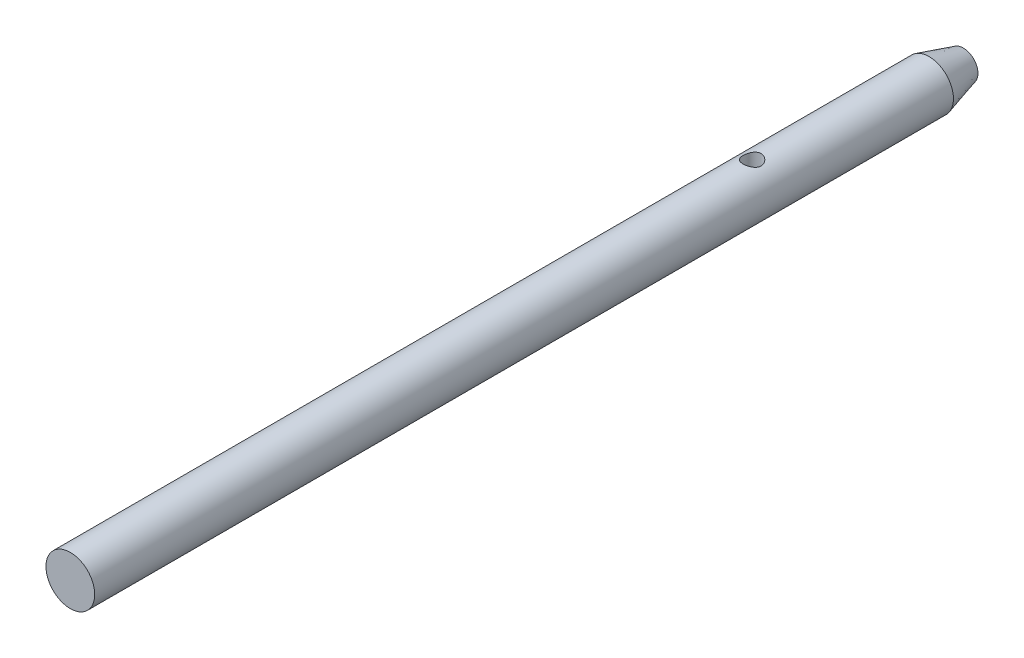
ISO-10303-21;
HEADER;
FILE_DESCRIPTION(('STEP AP214'),'2;1');
FILE_NAME('part.step','',(''),(''),'','','');
FILE_SCHEMA(('AUTOMOTIVE_DESIGN { 1 0 10303 214 1 1 1 1 }'));
ENDSEC;
DATA;
#1=APPLICATION_CONTEXT('core data for automotive mechanical design processes');
#2=APPLICATION_PROTOCOL_DEFINITION('international standard','automotive_design',2000,#1);
#3=PRODUCT_CONTEXT('',#1,'mechanical');
#4=PRODUCT('Part','Part','',(#3));
#5=PRODUCT_RELATED_PRODUCT_CATEGORY('part','',(#4));
#6=PRODUCT_DEFINITION_FORMATION('','',#4);
#7=PRODUCT_DEFINITION_CONTEXT('part definition',#1,'design');
#8=PRODUCT_DEFINITION('design','',#6,#7);
#9=PRODUCT_DEFINITION_SHAPE('','',#8);
#10=(LENGTH_UNIT() NAMED_UNIT(*) SI_UNIT(.MILLI.,.METRE.));
#11=(NAMED_UNIT(*) PLANE_ANGLE_UNIT() SI_UNIT($,.RADIAN.));
#12=(NAMED_UNIT(*) SI_UNIT($,.STERADIAN.) SOLID_ANGLE_UNIT());
#13=UNCERTAINTY_MEASURE_WITH_UNIT(LENGTH_MEASURE(1.E-05),#10,'distance_accuracy_value','');
#14=(GEOMETRIC_REPRESENTATION_CONTEXT(3) GLOBAL_UNCERTAINTY_ASSIGNED_CONTEXT((#13)) GLOBAL_UNIT_ASSIGNED_CONTEXT((#10,
#11,#12)) REPRESENTATION_CONTEXT('',''));
#15=CARTESIAN_POINT('',(0.,0.,0.));
#16=DIRECTION('',(0.,0.,1.));
#17=DIRECTION('',(1.,0.,0.));
#18=AXIS2_PLACEMENT_3D('',#15,#16,#17);
#19=CARTESIAN_POINT('',(0.,0.,78.2));
#20=DIRECTION('',(0.,0.,-1.));
#21=DIRECTION('',(-1.00000000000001,0.,0.));
#22=AXIS2_PLACEMENT_3D('',#19,#20,#21);
#23=CYLINDRICAL_SURFACE('',#22,2.135);
#24=CARTESIAN_POINT('',(0.,-2.135,19.2899999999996));
#25=CARTESIAN_POINT('',(-0.042823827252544,-2.1350009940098,19.2900013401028));
#26=CARTESIAN_POINT('',(-0.0856383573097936,-2.13370026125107,19.2865070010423));
#27=CARTESIAN_POINT('',(-0.169990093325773,-2.12864112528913,19.2726767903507));
#28=CARTESIAN_POINT('',(-0.211527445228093,-2.12488300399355,19.2623417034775));
#29=CARTESIAN_POINT('',(-0.292096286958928,-2.11531311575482,19.2352440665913));
#30=CARTESIAN_POINT('',(-0.331132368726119,-2.10950524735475,19.218493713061));
#31=CARTESIAN_POINT('',(-0.405838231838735,-2.09641609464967,19.1791021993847));
#32=CARTESIAN_POINT('',(-0.441507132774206,-2.08913442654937,19.1564595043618));
#33=CARTESIAN_POINT('',(-0.509946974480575,-2.07351338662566,19.1049435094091));
#34=CARTESIAN_POINT('',(-0.542559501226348,-2.06514462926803,19.0758687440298));
#35=CARTESIAN_POINT('',(-0.602572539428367,-2.04843928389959,19.012741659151));
#36=CARTESIAN_POINT('',(-0.629971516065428,-2.04010270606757,18.9786878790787));
#37=CARTESIAN_POINT('',(-0.679773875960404,-2.0240660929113,18.9050369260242));
#38=CARTESIAN_POINT('',(-0.701955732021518,-2.0164008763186,18.8652816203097));
#39=CARTESIAN_POINT('',(-0.739248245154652,-2.00303081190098,18.7822761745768));
#40=CARTESIAN_POINT('',(-0.754361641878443,-1.99732520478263,18.739027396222));
#41=CARTESIAN_POINT('',(-0.776466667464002,-1.98883394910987,18.6520839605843));
#42=CARTESIAN_POINT('',(-0.783760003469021,-1.98594026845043,18.6084769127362));
#43=CARTESIAN_POINT('',(-0.790961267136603,-1.98308390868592,18.5205692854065));
#44=CARTESIAN_POINT('',(-0.790872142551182,-1.98312005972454,18.4762689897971));
#45=CARTESIAN_POINT('',(-0.783542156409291,-1.98602593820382,18.3909682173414));
#46=CARTESIAN_POINT('',(-0.776716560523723,-1.98873113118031,18.3499254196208));
#47=CARTESIAN_POINT('',(-0.756792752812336,-1.99639737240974,18.2696154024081));
#48=CARTESIAN_POINT('',(-0.743693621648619,-2.00135875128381,18.2303484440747));
#49=CARTESIAN_POINT('',(-0.711361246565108,-2.01307961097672,18.1538464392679));
#50=CARTESIAN_POINT('',(-0.692018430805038,-2.01987082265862,18.1166627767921));
#51=CARTESIAN_POINT('',(-0.647824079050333,-2.03447524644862,18.0459472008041));
#52=CARTESIAN_POINT('',(-0.622970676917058,-2.04228880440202,18.0124165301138));
#53=CARTESIAN_POINT('',(-0.566549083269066,-2.05868010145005,17.947655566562));
#54=CARTESIAN_POINT('',(-0.534648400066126,-2.06727442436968,17.9167184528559));
#55=CARTESIAN_POINT('',(-0.466011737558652,-2.08381932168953,17.8605471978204));
#56=CARTESIAN_POINT('',(-0.429275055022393,-2.09176980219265,17.8353138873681));
#57=CARTESIAN_POINT('',(-0.351277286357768,-2.10628192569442,17.7909545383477));
#58=CARTESIAN_POINT('',(-0.309957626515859,-2.11282143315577,17.7719237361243));
#59=CARTESIAN_POINT('',(-0.224401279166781,-2.12361109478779,17.7411799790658));
#60=CARTESIAN_POINT('',(-0.180165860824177,-2.12786223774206,17.7294638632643));
#61=CARTESIAN_POINT('',(-0.0925029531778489,-2.1334236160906,17.7142401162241));
#62=CARTESIAN_POINT('',(-0.0491529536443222,-2.13487521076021,17.7103375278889));
#63=CARTESIAN_POINT('',(0.0376016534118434,-2.13510916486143,17.7097046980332));
#64=CARTESIAN_POINT('',(0.0810062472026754,-2.13389209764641,17.7129729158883));
#65=CARTESIAN_POINT('',(0.16494702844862,-2.12901880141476,17.726287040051));
#66=CARTESIAN_POINT('',(0.205529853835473,-2.12545500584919,17.7360762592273));
#67=CARTESIAN_POINT('',(0.284450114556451,-2.11633938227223,17.761818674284));
#68=CARTESIAN_POINT('',(0.322787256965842,-2.11078729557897,17.7777726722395));
#69=CARTESIAN_POINT('',(0.397376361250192,-2.09804456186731,17.8158967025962));
#70=CARTESIAN_POINT('',(0.433535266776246,-2.09081096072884,17.8382340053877));
#71=CARTESIAN_POINT('',(0.501711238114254,-2.07550803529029,17.8883006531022));
#72=CARTESIAN_POINT('',(0.533726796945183,-2.06743840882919,17.9160319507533));
#73=CARTESIAN_POINT('',(0.594596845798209,-2.05078801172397,17.9779430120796));
#74=CARTESIAN_POINT('',(0.623170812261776,-2.04220410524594,18.0123984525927));
#75=CARTESIAN_POINT('',(0.674184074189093,-2.02593678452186,18.0857865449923));
#76=CARTESIAN_POINT('',(0.69662289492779,-2.01825343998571,18.1247195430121));
#77=CARTESIAN_POINT('',(0.73473219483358,-2.00469605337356,18.2062344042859));
#78=CARTESIAN_POINT('',(0.750380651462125,-1.9988279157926,18.2488276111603));
#79=CARTESIAN_POINT('',(0.774184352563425,-1.9897309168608,18.3363211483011));
#80=CARTESIAN_POINT('',(0.782344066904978,-1.98650048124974,18.3812200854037));
#81=CARTESIAN_POINT('',(0.790544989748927,-1.98325016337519,18.469019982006));
#82=CARTESIAN_POINT('',(0.79106292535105,-1.98304176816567,18.5118698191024));
#83=CARTESIAN_POINT('',(0.785180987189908,-1.98537795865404,18.5970114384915));
#84=CARTESIAN_POINT('',(0.778781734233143,-1.98792229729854,18.6393032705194));
#85=CARTESIAN_POINT('',(0.759614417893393,-1.99532229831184,18.7208893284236));
#86=CARTESIAN_POINT('',(0.747035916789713,-2.00010898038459,18.7602348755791));
#87=CARTESIAN_POINT('',(0.716032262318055,-2.01141585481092,18.8362812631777));
#88=CARTESIAN_POINT('',(0.697605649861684,-2.01793647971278,18.8729814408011));
#89=CARTESIAN_POINT('',(0.654328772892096,-2.03239368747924,18.944745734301));
#90=CARTESIAN_POINT('',(0.629196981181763,-2.04038582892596,18.9796287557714));
#91=CARTESIAN_POINT('',(0.573663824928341,-2.05668945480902,19.0448349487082));
#92=CARTESIAN_POINT('',(0.543260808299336,-2.06500103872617,19.0751566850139));
#93=CARTESIAN_POINT('',(0.476152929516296,-2.08152744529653,19.131988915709));
#94=CARTESIAN_POINT('',(0.439202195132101,-2.08971464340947,19.1582183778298));
#95=CARTESIAN_POINT('',(0.3611311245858,-2.10461087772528,19.2040835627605));
#96=CARTESIAN_POINT('',(0.320010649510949,-2.11131986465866,19.2237190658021));
#97=CARTESIAN_POINT('',(0.233343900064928,-2.12267357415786,19.2562136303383));
#98=CARTESIAN_POINT('',(0.187697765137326,-2.12724489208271,19.2688341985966));
#99=CARTESIAN_POINT('',(0.0946967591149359,-2.13340685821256,19.2857246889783));
#100=CARTESIAN_POINT('',(0.0473426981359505,-2.13499890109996,19.2899985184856));
#101=CARTESIAN_POINT('',(0.,-2.135,19.2899999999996));
#102=B_SPLINE_CURVE_WITH_KNOTS('',3,(#24,#25,#26,#27,#28,#29,#30,#31,#32,#33,#34,#35,#36,#37,
#38,#39,#40,#41,#42,#43,#44,#45,#46,#47,#48,#49,#50,#51,#52,#53,#54,#55,#56,#57,#58,#59,#60,#61,
#62,#63,#64,#65,#66,#67,#68,#69,#70,#71,#72,#73,#74,#75,#76,#77,#78,#79,#80,#81,#82,#83,#84,#85,
#86,#87,#88,#89,#90,#91,#92,#93,#94,#95,#96,#97,#98,#99,#100,#101),.UNSPECIFIED.,.T.,.F.,(4,2,2,
2,2,2,2,2,2,2,2,2,2,2,2,2,2,2,2,2,2,2,2,2,2,2,2,2,2,2,2,2,2,2,2,2,2,2,4),(0.,0.128296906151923,
0.256579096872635,0.384618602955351,0.512691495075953,0.645557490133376,0.778462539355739,
0.916269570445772,1.0540231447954,1.18624628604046,1.318416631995,1.44291805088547,
1.5674377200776,1.69427365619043,1.82115261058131,1.95631650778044,2.09150008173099,
2.22867098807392,2.36578257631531,2.49576835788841,2.62572621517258,2.75084900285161,
2.87598807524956,3.00476618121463,3.13359099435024,3.26968911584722,3.40579776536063,
3.54234460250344,3.67880988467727,3.8067231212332,3.93462487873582,4.0588272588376,
4.18306065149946,4.31368056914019,4.44434149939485,4.58181288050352,4.71928884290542,
4.86119038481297,5.00302548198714),.UNSPECIFIED.);
#103=CARTESIAN_POINT('',(0.,-2.135,19.2899999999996));
#104=VERTEX_POINT('',#103);
#105=EDGE_CURVE('E50',#104,#104,#102,.T.);
#106=ORIENTED_EDGE('',*,*,#105,.F.);
#107=EDGE_LOOP('',(#106));
#108=FACE_BOUND('',#107,.T.);
#109=CARTESIAN_POINT('',(0.,2.13499999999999,17.7099999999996));
#110=CARTESIAN_POINT('',(0.0428238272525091,2.1350009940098,17.7099986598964));
#111=CARTESIAN_POINT('',(0.0856383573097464,2.13370026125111,17.713492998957));
#112=CARTESIAN_POINT('',(0.169990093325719,2.12864112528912,17.7273232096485));
#113=CARTESIAN_POINT('',(0.211527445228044,2.12488300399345,17.7376582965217));
#114=CARTESIAN_POINT('',(0.292096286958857,2.11531311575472,17.764755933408));
#115=CARTESIAN_POINT('',(0.33113236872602,2.10950524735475,17.7815062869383));
#116=CARTESIAN_POINT('',(0.405838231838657,2.09641609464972,17.8208978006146));
#117=CARTESIAN_POINT('',(0.441507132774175,2.08913442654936,17.8435404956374));
#118=CARTESIAN_POINT('',(0.509946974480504,2.07351338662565,17.8950564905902));
#119=CARTESIAN_POINT('',(0.542559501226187,2.06514462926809,17.9241312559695));
#120=CARTESIAN_POINT('',(0.602572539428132,2.04843928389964,17.9872583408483));
#121=CARTESIAN_POINT('',(0.629971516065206,2.04010270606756,18.0213121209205));
#122=CARTESIAN_POINT('',(0.679773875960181,2.02406609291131,18.094963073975));
#123=CARTESIAN_POINT('',(0.701955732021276,2.01640087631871,18.1347183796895));
#124=CARTESIAN_POINT('',(0.739248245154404,2.00303081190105,18.2177238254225));
#125=CARTESIAN_POINT('',(0.754361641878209,1.99732520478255,18.2609726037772));
#126=CARTESIAN_POINT('',(0.776466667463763,1.98883394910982,18.3479160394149));
#127=CARTESIAN_POINT('',(0.783760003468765,1.98594026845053,18.391523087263));
#128=CARTESIAN_POINT('',(0.790961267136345,1.98308390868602,18.4794307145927));
#129=CARTESIAN_POINT('',(0.790872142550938,1.98312005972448,18.5237310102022));
#130=CARTESIAN_POINT('',(0.783542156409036,1.98602593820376,18.6090317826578));
#131=CARTESIAN_POINT('',(0.776716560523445,1.9887311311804,18.6500745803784));
#132=CARTESIAN_POINT('',(0.75679275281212,1.99639737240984,18.7303845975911));
#133=CARTESIAN_POINT('',(0.743693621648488,2.00135875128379,18.7696515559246));
#134=CARTESIAN_POINT('',(0.711361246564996,2.01307961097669,18.8461535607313));
#135=CARTESIAN_POINT('',(0.692018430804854,2.0198708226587,18.8833372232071));
#136=CARTESIAN_POINT('',(0.647824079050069,2.03447524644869,18.9540527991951));
#137=CARTESIAN_POINT('',(0.622970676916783,2.04228880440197,18.9875834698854));
#138=CARTESIAN_POINT('',(0.566549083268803,2.05868010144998,19.0523444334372));
#139=CARTESIAN_POINT('',(0.534648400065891,2.06727442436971,19.0832815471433));
#140=CARTESIAN_POINT('',(0.466011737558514,2.0838193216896,19.1394528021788));
#141=CARTESIAN_POINT('',(0.429275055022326,2.09176980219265,19.1646861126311));
#142=CARTESIAN_POINT('',(0.351277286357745,2.10628192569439,19.2090454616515));
#143=CARTESIAN_POINT('',(0.309957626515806,2.11282143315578,19.2280762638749));
#144=CARTESIAN_POINT('',(0.224401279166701,2.12361109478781,19.2588200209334));
#145=CARTESIAN_POINT('',(0.180165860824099,2.12786223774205,19.2705361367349));
#146=CARTESIAN_POINT('',(0.0925029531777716,2.13342361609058,19.2857598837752));
#147=CARTESIAN_POINT('',(0.0491529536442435,2.13487521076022,19.2896624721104));
#148=CARTESIAN_POINT('',(-0.0376016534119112,2.13510916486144,19.290295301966));
#149=CARTESIAN_POINT('',(-0.081006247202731,2.1338920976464,19.287027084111));
#150=CARTESIAN_POINT('',(-0.164947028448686,2.12901880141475,19.2737129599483));
#151=CARTESIAN_POINT('',(-0.205529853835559,2.1254550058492,19.263923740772));
#152=CARTESIAN_POINT('',(-0.284450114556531,2.11633938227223,19.2381813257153));
#153=CARTESIAN_POINT('',(-0.322787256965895,2.11078729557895,19.2222273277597));
#154=CARTESIAN_POINT('',(-0.39737636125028,2.09804456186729,19.184103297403));
#155=CARTESIAN_POINT('',(-0.433535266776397,2.09081096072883,19.1617659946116));
#156=CARTESIAN_POINT('',(-0.501711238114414,2.07550803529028,19.1116993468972));
#157=CARTESIAN_POINT('',(-0.533726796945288,2.06743840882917,19.083968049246));
#158=CARTESIAN_POINT('',(-0.594596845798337,2.05078801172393,19.0220569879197));
#159=CARTESIAN_POINT('',(-0.62317081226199,2.0422041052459,18.9876015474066));
#160=CARTESIAN_POINT('',(-0.674184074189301,2.02593678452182,18.914213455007));
#161=CARTESIAN_POINT('',(-0.696622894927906,2.01825343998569,18.8752804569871));
#162=CARTESIAN_POINT('',(-0.734732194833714,2.00469605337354,18.7937655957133));
#163=CARTESIAN_POINT('',(-0.750380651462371,1.99882791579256,18.7511723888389));
#164=CARTESIAN_POINT('',(-0.774184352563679,1.98973091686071,18.6636788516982));
#165=CARTESIAN_POINT('',(-0.782344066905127,1.98650048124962,18.6187799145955));
#166=CARTESIAN_POINT('',(-0.790544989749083,1.98325016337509,18.5309800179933));
#167=CARTESIAN_POINT('',(-0.791062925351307,1.98304176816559,18.4881301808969));
#168=CARTESIAN_POINT('',(-0.785180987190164,1.98537795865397,18.4029885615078));
#169=CARTESIAN_POINT('',(-0.778781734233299,1.98792229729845,18.3606967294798));
#170=CARTESIAN_POINT('',(-0.759614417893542,1.99532229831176,18.2791106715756));
#171=CARTESIAN_POINT('',(-0.747035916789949,2.00010898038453,18.2397651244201));
#172=CARTESIAN_POINT('',(-0.716032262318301,2.01141585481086,18.1637187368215));
#173=CARTESIAN_POINT('',(-0.697605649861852,2.0179364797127,18.1270185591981));
#174=CARTESIAN_POINT('',(-0.654328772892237,2.03239368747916,18.0552542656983));
#175=CARTESIAN_POINT('',(-0.629196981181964,2.0403858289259,18.0203712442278));
#176=CARTESIAN_POINT('',(-0.573663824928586,2.056689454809,17.955165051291));
#177=CARTESIAN_POINT('',(-0.543260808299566,2.06500103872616,17.9248433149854));
#178=CARTESIAN_POINT('',(-0.476152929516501,2.08152744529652,17.8680110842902));
#179=CARTESIAN_POINT('',(-0.439202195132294,2.08971464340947,17.8417816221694));
#180=CARTESIAN_POINT('',(-0.36113112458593,2.10461087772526,17.7959164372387));
#181=CARTESIAN_POINT('',(-0.320010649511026,2.11131986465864,17.7762809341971));
#182=CARTESIAN_POINT('',(-0.233343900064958,2.12267357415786,17.743786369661));
#183=CARTESIAN_POINT('',(-0.187697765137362,2.12724489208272,17.7311658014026));
#184=CARTESIAN_POINT('',(-0.0946967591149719,2.13340685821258,17.7142753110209));
#185=CARTESIAN_POINT('',(-0.0473426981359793,2.13499890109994,17.7100014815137));
#186=CARTESIAN_POINT('',(0.,2.13499999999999,17.7099999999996));
#187=B_SPLINE_CURVE_WITH_KNOTS('',3,(#109,#110,#111,#112,#113,#114,#115,#116,#117,#118,#119,
#120,#121,#122,#123,#124,#125,#126,#127,#128,#129,#130,#131,#132,#133,#134,#135,#136,#137,#138,
#139,#140,#141,#142,#143,#144,#145,#146,#147,#148,#149,#150,#151,#152,#153,#154,#155,#156,#157,
#158,#159,#160,#161,#162,#163,#164,#165,#166,#167,#168,#169,#170,#171,#172,#173,#174,#175,#176,
#177,#178,#179,#180,#181,#182,#183,#184,#185,#186),.UNSPECIFIED.,.T.,.F.,(4,2,2,2,2,2,2,2,2,2,2,
2,2,2,2,2,2,2,2,2,2,2,2,2,2,2,2,2,2,2,2,2,2,2,2,2,2,2,4),(0.,0.128296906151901,
0.256579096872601,0.38461860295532,0.51269149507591,0.645557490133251,0.77846253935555,
0.916269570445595,1.05402314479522,1.18624628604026,1.3184166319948,1.44291805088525,
1.56743772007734,1.69427365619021,1.82115261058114,1.95631650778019,2.09150008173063,
2.22867098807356,2.36578257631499,2.49576835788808,2.62572621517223,2.75084900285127,
2.87598807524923,3.00476618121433,3.13359099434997,3.26968911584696,3.40579776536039,
3.54234460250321,3.67880988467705,3.80672312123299,3.93462487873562,4.05882725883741,
4.18306065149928,4.31368056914,4.44434149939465,4.58181288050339,4.71928884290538,
4.86119038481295,5.00302548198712),.UNSPECIFIED.);
#188=CARTESIAN_POINT('',(0.,2.13499999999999,17.7099999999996));
#189=VERTEX_POINT('',#188);
#190=EDGE_CURVE('E59',#189,#189,#187,.T.);
#191=ORIENTED_EDGE('',*,*,#190,.T.);
#192=EDGE_LOOP('',(#191));
#193=FACE_BOUND('',#192,.T.);
#194=CARTESIAN_POINT('',(0.,0.,3.));
#195=DIRECTION('',(0.,0.,1.));
#196=DIRECTION('',(1.00000000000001,0.,0.));
#197=AXIS2_PLACEMENT_3D('',#194,#195,#196);
#198=CIRCLE('',#197,2.135);
#199=CARTESIAN_POINT('',(2.13500000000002,0.,3.));
#200=VERTEX_POINT('',#199);
#201=EDGE_CURVE('E42',#200,#200,#198,.T.);
#202=ORIENTED_EDGE('',*,*,#201,.T.);
#203=EDGE_LOOP('',(#202));
#204=FACE_BOUND('',#203,.T.);
#205=CARTESIAN_POINT('',(0.,0.,78.2));
#206=DIRECTION('',(0.,0.,1.));
#207=DIRECTION('',(1.00000000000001,0.,0.));
#208=AXIS2_PLACEMENT_3D('',#205,#206,#207);
#209=CIRCLE('',#208,2.135);
#210=CARTESIAN_POINT('',(2.13499999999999,0.,78.2));
#211=VERTEX_POINT('',#210);
#212=EDGE_CURVE('E46',#211,#211,#209,.T.);
#213=ORIENTED_EDGE('',*,*,#212,.F.);
#214=EDGE_LOOP('',(#213));
#215=FACE_BOUND('',#214,.T.);
#216=ADVANCED_FACE('F36',(#108,#193,#204,#215),#23,.T.);
#217=CARTESIAN_POINT('',(0.,0.,78.2));
#218=DIRECTION('',(0.,0.,1.));
#219=DIRECTION('',(1.00000000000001,0.,0.));
#220=AXIS2_PLACEMENT_3D('',#217,#218,#219);
#221=PLANE('',#220);
#222=ORIENTED_EDGE('',*,*,#212,.T.);
#223=EDGE_LOOP('',(#222));
#224=FACE_BOUND('',#223,.T.);
#225=ADVANCED_FACE('F78',(#224),#221,.T.);
#226=CARTESIAN_POINT('',(0.,0.,0.));
#227=DIRECTION('',(0.,0.,1.));
#228=DIRECTION('',(1.00000000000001,0.,0.));
#229=AXIS2_PLACEMENT_3D('',#226,#227,#228);
#230=PLANE('',#229);
#231=CARTESIAN_POINT('',(0.,0.,0.));
#232=DIRECTION('',(0.,0.,1.));
#233=DIRECTION('',(1.00000000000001,0.,0.));
#234=AXIS2_PLACEMENT_3D('',#231,#232,#233);
#235=CIRCLE('',#234,1.285);
#236=CARTESIAN_POINT('',(1.28500000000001,0.,0.));
#237=VERTEX_POINT('',#236);
#238=EDGE_CURVE('E10',#237,#237,#235,.F.);
#239=ORIENTED_EDGE('',*,*,#238,.T.);
#240=EDGE_LOOP('',(#239));
#241=FACE_BOUND('',#240,.T.);
#242=ADVANCED_FACE('F75',(#241),#230,.F.);
#243=CARTESIAN_POINT('',(0.,0.,3.));
#244=DIRECTION('',(0.,0.,1.));
#245=DIRECTION('',(1.00000000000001,0.,0.));
#246=AXIS2_PLACEMENT_3D('',#243,#244,#245);
#247=CONICAL_SURFACE('',#246,2.135,0.276097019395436);
#248=ORIENTED_EDGE('',*,*,#238,.F.);
#249=EDGE_LOOP('',(#248));
#250=FACE_BOUND('',#249,.T.);
#251=ORIENTED_EDGE('',*,*,#201,.F.);
#252=EDGE_LOOP('',(#251));
#253=FACE_BOUND('',#252,.T.);
#254=ADVANCED_FACE('F71',(#250,#253),#247,.T.);
#255=CARTESIAN_POINT('',(-1.73472347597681E-13,-2.13600000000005,18.4999999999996));
#256=DIRECTION('',(0.,1.00000000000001,0.));
#257=DIRECTION('',(0.,0.,1.));
#258=AXIS2_PLACEMENT_3D('',#255,#256,#257);
#259=CYLINDRICAL_SURFACE('',#258,0.79);
#260=ORIENTED_EDGE('',*,*,#105,.T.);
#261=EDGE_LOOP('',(#260));
#262=FACE_BOUND('',#261,.T.);
#263=ORIENTED_EDGE('',*,*,#190,.F.);
#264=EDGE_LOOP('',(#263));
#265=FACE_BOUND('',#264,.T.);
#266=ADVANCED_FACE('F64',(#262,#265),#259,.F.);
#267=CLOSED_SHELL('',(#216,#225,#242,#254,#266));
#268=MANIFOLD_SOLID_BREP('B2',#267);
#269=ADVANCED_BREP_SHAPE_REPRESENTATION('',(#18,#268),#14);
#270=SHAPE_DEFINITION_REPRESENTATION(#9,#269);
ENDSEC;
END-ISO-10303-21;
